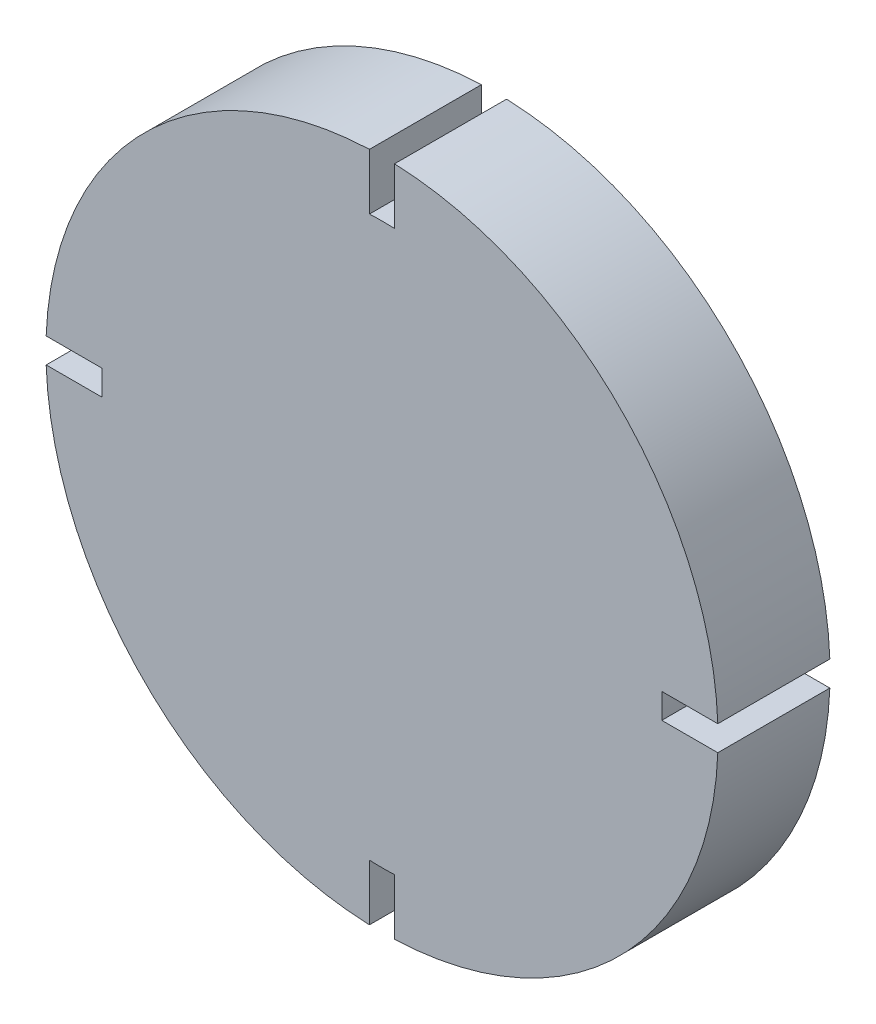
ISO-10303-21;
HEADER;
FILE_DESCRIPTION(('STEP AP214'),'2;1');
FILE_NAME('part.step','',(''),(''),'','','');
FILE_SCHEMA(('AUTOMOTIVE_DESIGN { 1 0 10303 214 1 1 1 1 }'));
ENDSEC;
DATA;
#1=APPLICATION_CONTEXT('core data for automotive mechanical design processes');
#2=APPLICATION_PROTOCOL_DEFINITION('international standard','automotive_design',2000,#1);
#3=PRODUCT_CONTEXT('',#1,'mechanical');
#4=PRODUCT('Part','Part','',(#3));
#5=PRODUCT_RELATED_PRODUCT_CATEGORY('part','',(#4));
#6=PRODUCT_DEFINITION_FORMATION('','',#4);
#7=PRODUCT_DEFINITION_CONTEXT('part definition',#1,'design');
#8=PRODUCT_DEFINITION('design','',#6,#7);
#9=PRODUCT_DEFINITION_SHAPE('','',#8);
#10=(LENGTH_UNIT() NAMED_UNIT(*) SI_UNIT(.MILLI.,.METRE.));
#11=(NAMED_UNIT(*) PLANE_ANGLE_UNIT() SI_UNIT($,.RADIAN.));
#12=(NAMED_UNIT(*) SI_UNIT($,.STERADIAN.) SOLID_ANGLE_UNIT());
#13=UNCERTAINTY_MEASURE_WITH_UNIT(LENGTH_MEASURE(1.E-05),#10,'distance_accuracy_value','');
#14=(GEOMETRIC_REPRESENTATION_CONTEXT(3) GLOBAL_UNCERTAINTY_ASSIGNED_CONTEXT((#13)) GLOBAL_UNIT_ASSIGNED_CONTEXT((#10,
#11,#12)) REPRESENTATION_CONTEXT('',''));
#15=CARTESIAN_POINT('',(0.,0.,0.));
#16=DIRECTION('',(0.,0.,1.));
#17=DIRECTION('',(1.,0.,0.));
#18=AXIS2_PLACEMENT_3D('',#15,#16,#17);
#19=CARTESIAN_POINT('',(0.,0.,10.));
#20=DIRECTION('',(0.,0.,-1.));
#21=DIRECTION('',(-1.,0.,0.));
#22=AXIS2_PLACEMENT_3D('',#19,#20,#21);
#23=CYLINDRICAL_SURFACE('',#22,30.);
#24=CARTESIAN_POINT('',(0.,0.,0.));
#25=DIRECTION('',(0.,0.,1.));
#26=DIRECTION('',(1.,0.,0.));
#27=AXIS2_PLACEMENT_3D('',#24,#25,#26);
#28=CIRCLE('',#27,30.);
#29=CARTESIAN_POINT('',(-1.12,29.9790860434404,0.));
#30=VERTEX_POINT('',#29);
#31=CARTESIAN_POINT('',(-29.9790860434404,1.12,0.));
#32=VERTEX_POINT('',#31);
#33=EDGE_CURVE('E177',#30,#32,#28,.T.);
#34=ORIENTED_EDGE('',*,*,#33,.T.);
#35=DIRECTION('',(0.,0.,-1.));
#36=VECTOR('',#35,1.);
#37=CARTESIAN_POINT('',(-29.9790860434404,1.12,10.));
#38=LINE('',#37,#36);
#39=CARTESIAN_POINT('',(-29.9790860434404,1.12,10.));
#40=VERTEX_POINT('',#39);
#41=EDGE_CURVE('E11',#40,#32,#38,.T.);
#42=ORIENTED_EDGE('',*,*,#41,.F.);
#43=CARTESIAN_POINT('',(0.,0.,10.));
#44=DIRECTION('',(0.,0.,1.));
#45=DIRECTION('',(1.,0.,0.));
#46=AXIS2_PLACEMENT_3D('',#43,#44,#45);
#47=CIRCLE('',#46,30.);
#48=CARTESIAN_POINT('',(-1.12,29.9790860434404,10.));
#49=VERTEX_POINT('',#48);
#50=EDGE_CURVE('E207',#49,#40,#47,.T.);
#51=ORIENTED_EDGE('',*,*,#50,.F.);
#52=DIRECTION('',(0.,0.,-1.));
#53=VECTOR('',#52,1.);
#54=CARTESIAN_POINT('',(-1.12,29.9790860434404,10.));
#55=LINE('',#54,#53);
#56=EDGE_CURVE('E173',#49,#30,#55,.T.);
#57=ORIENTED_EDGE('',*,*,#56,.T.);
#58=EDGE_LOOP('',(#34,#42,#51,#57));
#59=FACE_BOUND('',#58,.T.);
#60=ADVANCED_FACE('F33',(#59),#23,.T.);
#61=CARTESIAN_POINT('',(-29.9790860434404,1.12,10.));
#62=DIRECTION('',(0.,1.,0.));
#63=DIRECTION('',(-1.,0.,0.));
#64=AXIS2_PLACEMENT_3D('',#61,#62,#63);
#65=PLANE('',#64);
#66=DIRECTION('',(1.,0.,0.));
#67=VECTOR('',#66,1.);
#68=CARTESIAN_POINT('',(-29.9790860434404,1.12,0.));
#69=LINE('',#68,#67);
#70=CARTESIAN_POINT('',(-24.9748993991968,1.12,0.));
#71=VERTEX_POINT('',#70);
#72=EDGE_CURVE('E180',#32,#71,#69,.T.);
#73=ORIENTED_EDGE('',*,*,#72,.T.);
#74=DIRECTION('',(0.,0.,-1.));
#75=VECTOR('',#74,1.);
#76=CARTESIAN_POINT('',(-24.9748993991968,1.12,10.));
#77=LINE('',#76,#75);
#78=CARTESIAN_POINT('',(-24.9748993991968,1.12,10.));
#79=VERTEX_POINT('',#78);
#80=EDGE_CURVE('E41',#79,#71,#77,.T.);
#81=ORIENTED_EDGE('',*,*,#80,.F.);
#82=DIRECTION('',(1.,0.,0.));
#83=VECTOR('',#82,1.);
#84=CARTESIAN_POINT('',(-29.9790860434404,1.12,10.));
#85=LINE('',#84,#83);
#86=EDGE_CURVE('E116',#40,#79,#85,.T.);
#87=ORIENTED_EDGE('',*,*,#86,.F.);
#88=ORIENTED_EDGE('',*,*,#41,.T.);
#89=EDGE_LOOP('',(#73,#81,#87,#88));
#90=FACE_BOUND('',#89,.T.);
#91=ADVANCED_FACE('F305',(#90),#65,.F.);
#92=CARTESIAN_POINT('',(0.,0.,10.));
#93=DIRECTION('',(0.,0.,-1.));
#94=DIRECTION('',(-1.,0.,0.));
#95=AXIS2_PLACEMENT_3D('',#92,#93,#94);
#96=CYLINDRICAL_SURFACE('',#95,25.);
#97=CARTESIAN_POINT('',(0.,0.,0.));
#98=DIRECTION('',(0.,0.,1.));
#99=DIRECTION('',(1.,0.,0.));
#100=AXIS2_PLACEMENT_3D('',#97,#98,#99);
#101=CIRCLE('',#100,25.);
#102=CARTESIAN_POINT('',(-24.9748993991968,-1.12000000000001,0.));
#103=VERTEX_POINT('',#102);
#104=EDGE_CURVE('E182',#71,#103,#101,.T.);
#105=ORIENTED_EDGE('',*,*,#104,.T.);
#106=DIRECTION('',(0.,0.,-1.));
#107=VECTOR('',#106,1.);
#108=CARTESIAN_POINT('',(-24.9748993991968,-1.12000000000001,10.));
#109=LINE('',#108,#107);
#110=CARTESIAN_POINT('',(-24.9748993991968,-1.12000000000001,10.));
#111=VERTEX_POINT('',#110);
#112=EDGE_CURVE('E238',#111,#103,#109,.T.);
#113=ORIENTED_EDGE('',*,*,#112,.F.);
#114=CARTESIAN_POINT('',(0.,0.,10.));
#115=DIRECTION('',(0.,0.,1.));
#116=DIRECTION('',(1.,0.,0.));
#117=AXIS2_PLACEMENT_3D('',#114,#115,#116);
#118=CIRCLE('',#117,25.);
#119=EDGE_CURVE('E246',#79,#111,#118,.T.);
#120=ORIENTED_EDGE('',*,*,#119,.F.);
#121=ORIENTED_EDGE('',*,*,#80,.T.);
#122=EDGE_LOOP('',(#105,#113,#120,#121));
#123=FACE_BOUND('',#122,.T.);
#124=ADVANCED_FACE('F244',(#123),#96,.T.);
#125=CARTESIAN_POINT('',(-29.9790860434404,-1.12000000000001,10.));
#126=DIRECTION('',(0.,-1.,0.));
#127=DIRECTION('',(1.,0.,0.));
#128=AXIS2_PLACEMENT_3D('',#125,#126,#127);
#129=PLANE('',#128);
#130=DIRECTION('',(-1.,0.,0.));
#131=VECTOR('',#130,1.);
#132=CARTESIAN_POINT('',(-29.9790860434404,-1.12000000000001,0.));
#133=LINE('',#132,#131);
#134=CARTESIAN_POINT('',(-29.9790860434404,-1.12000000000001,0.));
#135=VERTEX_POINT('',#134);
#136=EDGE_CURVE('E184',#103,#135,#133,.T.);
#137=ORIENTED_EDGE('',*,*,#136,.T.);
#138=DIRECTION('',(0.,0.,-1.));
#139=VECTOR('',#138,1.);
#140=CARTESIAN_POINT('',(-29.9790860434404,-1.12000000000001,10.));
#141=LINE('',#140,#139);
#142=CARTESIAN_POINT('',(-29.9790860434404,-1.12000000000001,10.));
#143=VERTEX_POINT('',#142);
#144=EDGE_CURVE('E235',#143,#135,#141,.T.);
#145=ORIENTED_EDGE('',*,*,#144,.F.);
#146=DIRECTION('',(-1.,0.,0.));
#147=VECTOR('',#146,1.);
#148=CARTESIAN_POINT('',(-29.9790860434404,-1.12000000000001,10.));
#149=LINE('',#148,#147);
#150=EDGE_CURVE('E264',#111,#143,#149,.T.);
#151=ORIENTED_EDGE('',*,*,#150,.F.);
#152=ORIENTED_EDGE('',*,*,#112,.T.);
#153=EDGE_LOOP('',(#137,#145,#151,#152));
#154=FACE_BOUND('',#153,.T.);
#155=ADVANCED_FACE('F255',(#154),#129,.F.);
#156=CARTESIAN_POINT('',(0.,0.,10.));
#157=DIRECTION('',(0.,0.,-1.));
#158=DIRECTION('',(-1.,0.,0.));
#159=AXIS2_PLACEMENT_3D('',#156,#157,#158);
#160=CYLINDRICAL_SURFACE('',#159,30.);
#161=CARTESIAN_POINT('',(0.,0.,0.));
#162=DIRECTION('',(0.,0.,1.));
#163=DIRECTION('',(1.,0.,0.));
#164=AXIS2_PLACEMENT_3D('',#161,#162,#163);
#165=CIRCLE('',#164,30.);
#166=CARTESIAN_POINT('',(-1.12,-29.9790860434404,0.));
#167=VERTEX_POINT('',#166);
#168=EDGE_CURVE('E186',#135,#167,#165,.T.);
#169=ORIENTED_EDGE('',*,*,#168,.T.);
#170=DIRECTION('',(0.,0.,-1.));
#171=VECTOR('',#170,1.);
#172=CARTESIAN_POINT('',(-1.12,-29.9790860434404,10.));
#173=LINE('',#172,#171);
#174=CARTESIAN_POINT('',(-1.12,-29.9790860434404,10.));
#175=VERTEX_POINT('',#174);
#176=EDGE_CURVE('E232',#175,#167,#173,.T.);
#177=ORIENTED_EDGE('',*,*,#176,.F.);
#178=CARTESIAN_POINT('',(0.,0.,10.));
#179=DIRECTION('',(0.,0.,1.));
#180=DIRECTION('',(1.,0.,0.));
#181=AXIS2_PLACEMENT_3D('',#178,#179,#180);
#182=CIRCLE('',#181,30.);
#183=EDGE_CURVE('E261',#143,#175,#182,.T.);
#184=ORIENTED_EDGE('',*,*,#183,.F.);
#185=ORIENTED_EDGE('',*,*,#144,.T.);
#186=EDGE_LOOP('',(#169,#177,#184,#185));
#187=FACE_BOUND('',#186,.T.);
#188=ADVANCED_FACE('F259',(#187),#160,.T.);
#189=CARTESIAN_POINT('',(-1.12,-29.9790860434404,10.));
#190=DIRECTION('',(-1.,0.,0.));
#191=DIRECTION('',(0.,-1.,0.));
#192=AXIS2_PLACEMENT_3D('',#189,#190,#191);
#193=PLANE('',#192);
#194=DIRECTION('',(0.,1.,0.));
#195=VECTOR('',#194,1.);
#196=CARTESIAN_POINT('',(-1.12,-29.9790860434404,0.));
#197=LINE('',#196,#195);
#198=CARTESIAN_POINT('',(-1.12000000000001,-24.9748993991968,0.));
#199=VERTEX_POINT('',#198);
#200=EDGE_CURVE('E188',#167,#199,#197,.T.);
#201=ORIENTED_EDGE('',*,*,#200,.T.);
#202=DIRECTION('',(0.,0.,-1.));
#203=VECTOR('',#202,1.);
#204=CARTESIAN_POINT('',(-1.12000000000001,-24.9748993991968,10.));
#205=LINE('',#204,#203);
#206=CARTESIAN_POINT('',(-1.12000000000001,-24.9748993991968,10.));
#207=VERTEX_POINT('',#206);
#208=EDGE_CURVE('E229',#207,#199,#205,.T.);
#209=ORIENTED_EDGE('',*,*,#208,.F.);
#210=DIRECTION('',(0.,1.,0.));
#211=VECTOR('',#210,1.);
#212=CARTESIAN_POINT('',(-1.12,-29.9790860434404,10.));
#213=LINE('',#212,#211);
#214=EDGE_CURVE('E263',#175,#207,#213,.T.);
#215=ORIENTED_EDGE('',*,*,#214,.F.);
#216=ORIENTED_EDGE('',*,*,#176,.T.);
#217=EDGE_LOOP('',(#201,#209,#215,#216));
#218=FACE_BOUND('',#217,.T.);
#219=ADVANCED_FACE('F318',(#218),#193,.F.);
#220=CARTESIAN_POINT('',(0.,0.,10.));
#221=DIRECTION('',(0.,0.,-1.));
#222=DIRECTION('',(-1.,0.,0.));
#223=AXIS2_PLACEMENT_3D('',#220,#221,#222);
#224=CYLINDRICAL_SURFACE('',#223,25.);
#225=CARTESIAN_POINT('',(0.,0.,0.));
#226=DIRECTION('',(0.,0.,1.));
#227=DIRECTION('',(1.,0.,0.));
#228=AXIS2_PLACEMENT_3D('',#225,#226,#227);
#229=CIRCLE('',#228,25.);
#230=CARTESIAN_POINT('',(1.12000000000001,-24.9748993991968,0.));
#231=VERTEX_POINT('',#230);
#232=EDGE_CURVE('E190',#199,#231,#229,.T.);
#233=ORIENTED_EDGE('',*,*,#232,.T.);
#234=DIRECTION('',(0.,0.,-1.));
#235=VECTOR('',#234,1.);
#236=CARTESIAN_POINT('',(1.12000000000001,-24.9748993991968,10.));
#237=LINE('',#236,#235);
#238=CARTESIAN_POINT('',(1.12000000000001,-24.9748993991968,10.));
#239=VERTEX_POINT('',#238);
#240=EDGE_CURVE('E226',#239,#231,#237,.T.);
#241=ORIENTED_EDGE('',*,*,#240,.F.);
#242=CARTESIAN_POINT('',(0.,0.,10.));
#243=DIRECTION('',(0.,0.,1.));
#244=DIRECTION('',(1.,0.,0.));
#245=AXIS2_PLACEMENT_3D('',#242,#243,#244);
#246=CIRCLE('',#245,25.);
#247=EDGE_CURVE('E266',#207,#239,#246,.T.);
#248=ORIENTED_EDGE('',*,*,#247,.F.);
#249=ORIENTED_EDGE('',*,*,#208,.T.);
#250=EDGE_LOOP('',(#233,#241,#248,#249));
#251=FACE_BOUND('',#250,.T.);
#252=ADVANCED_FACE('F321',(#251),#224,.T.);
#253=CARTESIAN_POINT('',(1.12000000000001,-29.9790860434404,10.));
#254=DIRECTION('',(1.,0.,0.));
#255=DIRECTION('',(0.,1.,0.));
#256=AXIS2_PLACEMENT_3D('',#253,#254,#255);
#257=PLANE('',#256);
#258=DIRECTION('',(0.,-1.,0.));
#259=VECTOR('',#258,1.);
#260=CARTESIAN_POINT('',(1.12000000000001,-29.9790860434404,0.));
#261=LINE('',#260,#259);
#262=CARTESIAN_POINT('',(1.12000000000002,-29.9790860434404,0.));
#263=VERTEX_POINT('',#262);
#264=EDGE_CURVE('E192',#231,#263,#261,.T.);
#265=ORIENTED_EDGE('',*,*,#264,.T.);
#266=DIRECTION('',(0.,0.,-1.));
#267=VECTOR('',#266,1.);
#268=CARTESIAN_POINT('',(1.12000000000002,-29.9790860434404,10.));
#269=LINE('',#268,#267);
#270=CARTESIAN_POINT('',(1.12000000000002,-29.9790860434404,10.));
#271=VERTEX_POINT('',#270);
#272=EDGE_CURVE('E223',#271,#263,#269,.T.);
#273=ORIENTED_EDGE('',*,*,#272,.F.);
#274=DIRECTION('',(0.,-1.,0.));
#275=VECTOR('',#274,1.);
#276=CARTESIAN_POINT('',(1.12000000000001,-29.9790860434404,10.));
#277=LINE('',#276,#275);
#278=EDGE_CURVE('E272',#239,#271,#277,.T.);
#279=ORIENTED_EDGE('',*,*,#278,.F.);
#280=ORIENTED_EDGE('',*,*,#240,.T.);
#281=EDGE_LOOP('',(#265,#273,#279,#280));
#282=FACE_BOUND('',#281,.T.);
#283=ADVANCED_FACE('F325',(#282),#257,.F.);
#284=CARTESIAN_POINT('',(0.,0.,10.));
#285=DIRECTION('',(0.,0.,-1.));
#286=DIRECTION('',(-1.,0.,0.));
#287=AXIS2_PLACEMENT_3D('',#284,#285,#286);
#288=CYLINDRICAL_SURFACE('',#287,30.);
#289=CARTESIAN_POINT('',(0.,0.,0.));
#290=DIRECTION('',(0.,0.,1.));
#291=DIRECTION('',(1.,0.,0.));
#292=AXIS2_PLACEMENT_3D('',#289,#290,#291);
#293=CIRCLE('',#292,30.);
#294=CARTESIAN_POINT('',(29.9790860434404,-1.12,0.));
#295=VERTEX_POINT('',#294);
#296=EDGE_CURVE('E194',#263,#295,#293,.T.);
#297=ORIENTED_EDGE('',*,*,#296,.T.);
#298=DIRECTION('',(0.,0.,-1.));
#299=VECTOR('',#298,1.);
#300=CARTESIAN_POINT('',(29.9790860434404,-1.12,10.));
#301=LINE('',#300,#299);
#302=CARTESIAN_POINT('',(29.9790860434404,-1.12,10.));
#303=VERTEX_POINT('',#302);
#304=EDGE_CURVE('E220',#303,#295,#301,.T.);
#305=ORIENTED_EDGE('',*,*,#304,.F.);
#306=CARTESIAN_POINT('',(0.,0.,10.));
#307=DIRECTION('',(0.,0.,1.));
#308=DIRECTION('',(1.,0.,0.));
#309=AXIS2_PLACEMENT_3D('',#306,#307,#308);
#310=CIRCLE('',#309,30.);
#311=EDGE_CURVE('E274',#271,#303,#310,.T.);
#312=ORIENTED_EDGE('',*,*,#311,.F.);
#313=ORIENTED_EDGE('',*,*,#272,.T.);
#314=EDGE_LOOP('',(#297,#305,#312,#313));
#315=FACE_BOUND('',#314,.T.);
#316=ADVANCED_FACE('F329',(#315),#288,.T.);
#317=CARTESIAN_POINT('',(29.9790860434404,-1.12,10.));
#318=DIRECTION('',(0.,-1.,0.));
#319=DIRECTION('',(1.,0.,0.));
#320=AXIS2_PLACEMENT_3D('',#317,#318,#319);
#321=PLANE('',#320);
#322=DIRECTION('',(-1.,0.,0.));
#323=VECTOR('',#322,1.);
#324=CARTESIAN_POINT('',(29.9790860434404,-1.12,0.));
#325=LINE('',#324,#323);
#326=CARTESIAN_POINT('',(24.9748993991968,-1.12000000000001,0.));
#327=VERTEX_POINT('',#326);
#328=EDGE_CURVE('E196',#295,#327,#325,.T.);
#329=ORIENTED_EDGE('',*,*,#328,.T.);
#330=DIRECTION('',(0.,0.,-1.));
#331=VECTOR('',#330,1.);
#332=CARTESIAN_POINT('',(24.9748993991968,-1.12000000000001,10.));
#333=LINE('',#332,#331);
#334=CARTESIAN_POINT('',(24.9748993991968,-1.12000000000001,10.));
#335=VERTEX_POINT('',#334);
#336=EDGE_CURVE('E217',#335,#327,#333,.T.);
#337=ORIENTED_EDGE('',*,*,#336,.F.);
#338=DIRECTION('',(-1.,0.,0.));
#339=VECTOR('',#338,1.);
#340=CARTESIAN_POINT('',(29.9790860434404,-1.12,10.));
#341=LINE('',#340,#339);
#342=EDGE_CURVE('E276',#303,#335,#341,.T.);
#343=ORIENTED_EDGE('',*,*,#342,.F.);
#344=ORIENTED_EDGE('',*,*,#304,.T.);
#345=EDGE_LOOP('',(#329,#337,#343,#344));
#346=FACE_BOUND('',#345,.T.);
#347=ADVANCED_FACE('F333',(#346),#321,.F.);
#348=CARTESIAN_POINT('',(0.,0.,10.));
#349=DIRECTION('',(0.,0.,-1.));
#350=DIRECTION('',(-1.,0.,0.));
#351=AXIS2_PLACEMENT_3D('',#348,#349,#350);
#352=CYLINDRICAL_SURFACE('',#351,25.);
#353=CARTESIAN_POINT('',(0.,0.,0.));
#354=DIRECTION('',(0.,0.,1.));
#355=DIRECTION('',(1.,0.,0.));
#356=AXIS2_PLACEMENT_3D('',#353,#354,#355);
#357=CIRCLE('',#356,25.);
#358=CARTESIAN_POINT('',(24.9748993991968,1.12000000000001,0.));
#359=VERTEX_POINT('',#358);
#360=EDGE_CURVE('E198',#327,#359,#357,.T.);
#361=ORIENTED_EDGE('',*,*,#360,.T.);
#362=DIRECTION('',(0.,0.,-1.));
#363=VECTOR('',#362,1.);
#364=CARTESIAN_POINT('',(24.9748993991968,1.12000000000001,10.));
#365=LINE('',#364,#363);
#366=CARTESIAN_POINT('',(24.9748993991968,1.12000000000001,10.));
#367=VERTEX_POINT('',#366);
#368=EDGE_CURVE('E214',#367,#359,#365,.T.);
#369=ORIENTED_EDGE('',*,*,#368,.F.);
#370=CARTESIAN_POINT('',(0.,0.,10.));
#371=DIRECTION('',(0.,0.,1.));
#372=DIRECTION('',(1.,0.,0.));
#373=AXIS2_PLACEMENT_3D('',#370,#371,#372);
#374=CIRCLE('',#373,25.);
#375=EDGE_CURVE('E278',#335,#367,#374,.T.);
#376=ORIENTED_EDGE('',*,*,#375,.F.);
#377=ORIENTED_EDGE('',*,*,#336,.T.);
#378=EDGE_LOOP('',(#361,#369,#376,#377));
#379=FACE_BOUND('',#378,.T.);
#380=ADVANCED_FACE('F337',(#379),#352,.T.);
#381=CARTESIAN_POINT('',(29.9790860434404,1.12000000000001,10.));
#382=DIRECTION('',(0.,1.,0.));
#383=DIRECTION('',(-1.,0.,0.));
#384=AXIS2_PLACEMENT_3D('',#381,#382,#383);
#385=PLANE('',#384);
#386=DIRECTION('',(1.,0.,0.));
#387=VECTOR('',#386,1.);
#388=CARTESIAN_POINT('',(29.9790860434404,1.12000000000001,0.));
#389=LINE('',#388,#387);
#390=CARTESIAN_POINT('',(29.9790860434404,1.12000000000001,0.));
#391=VERTEX_POINT('',#390);
#392=EDGE_CURVE('E200',#359,#391,#389,.T.);
#393=ORIENTED_EDGE('',*,*,#392,.T.);
#394=DIRECTION('',(0.,0.,-1.));
#395=VECTOR('',#394,1.);
#396=CARTESIAN_POINT('',(29.9790860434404,1.12000000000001,10.));
#397=LINE('',#396,#395);
#398=CARTESIAN_POINT('',(29.9790860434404,1.12000000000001,10.));
#399=VERTEX_POINT('',#398);
#400=EDGE_CURVE('E211',#399,#391,#397,.T.);
#401=ORIENTED_EDGE('',*,*,#400,.F.);
#402=DIRECTION('',(1.,0.,0.));
#403=VECTOR('',#402,1.);
#404=CARTESIAN_POINT('',(29.9790860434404,1.12000000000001,10.));
#405=LINE('',#404,#403);
#406=EDGE_CURVE('E280',#367,#399,#405,.T.);
#407=ORIENTED_EDGE('',*,*,#406,.F.);
#408=ORIENTED_EDGE('',*,*,#368,.T.);
#409=EDGE_LOOP('',(#393,#401,#407,#408));
#410=FACE_BOUND('',#409,.T.);
#411=ADVANCED_FACE('F286',(#410),#385,.F.);
#412=CARTESIAN_POINT('',(0.,0.,10.));
#413=DIRECTION('',(0.,0.,-1.));
#414=DIRECTION('',(-1.,0.,0.));
#415=AXIS2_PLACEMENT_3D('',#412,#413,#414);
#416=CYLINDRICAL_SURFACE('',#415,30.);
#417=CARTESIAN_POINT('',(0.,0.,0.));
#418=DIRECTION('',(0.,0.,1.));
#419=DIRECTION('',(1.,0.,0.));
#420=AXIS2_PLACEMENT_3D('',#417,#418,#419);
#421=CIRCLE('',#420,30.);
#422=CARTESIAN_POINT('',(1.12,29.9790860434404,0.));
#423=VERTEX_POINT('',#422);
#424=EDGE_CURVE('E202',#391,#423,#421,.T.);
#425=ORIENTED_EDGE('',*,*,#424,.T.);
#426=DIRECTION('',(0.,0.,-1.));
#427=VECTOR('',#426,1.);
#428=CARTESIAN_POINT('',(1.12,29.9790860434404,10.));
#429=LINE('',#428,#427);
#430=CARTESIAN_POINT('',(1.12,29.9790860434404,10.));
#431=VERTEX_POINT('',#430);
#432=EDGE_CURVE('E168',#431,#423,#429,.T.);
#433=ORIENTED_EDGE('',*,*,#432,.F.);
#434=CARTESIAN_POINT('',(0.,0.,10.));
#435=DIRECTION('',(0.,0.,1.));
#436=DIRECTION('',(1.,0.,0.));
#437=AXIS2_PLACEMENT_3D('',#434,#435,#436);
#438=CIRCLE('',#437,30.);
#439=EDGE_CURVE('E159',#399,#431,#438,.T.);
#440=ORIENTED_EDGE('',*,*,#439,.F.);
#441=ORIENTED_EDGE('',*,*,#400,.T.);
#442=EDGE_LOOP('',(#425,#433,#440,#441));
#443=FACE_BOUND('',#442,.T.);
#444=ADVANCED_FACE('F290',(#443),#416,.T.);
#445=CARTESIAN_POINT('',(1.12,29.9790860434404,10.));
#446=DIRECTION('',(1.,0.,0.));
#447=DIRECTION('',(0.,1.,0.));
#448=AXIS2_PLACEMENT_3D('',#445,#446,#447);
#449=PLANE('',#448);
#450=DIRECTION('',(0.,-1.,0.));
#451=VECTOR('',#450,1.);
#452=CARTESIAN_POINT('',(1.12,29.9790860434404,0.));
#453=LINE('',#452,#451);
#454=CARTESIAN_POINT('',(1.12,24.9748993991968,0.));
#455=VERTEX_POINT('',#454);
#456=EDGE_CURVE('E167',#423,#455,#453,.T.);
#457=ORIENTED_EDGE('',*,*,#456,.T.);
#458=DIRECTION('',(0.,0.,-1.));
#459=VECTOR('',#458,1.);
#460=CARTESIAN_POINT('',(1.12,24.9748993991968,10.));
#461=LINE('',#460,#459);
#462=CARTESIAN_POINT('',(1.12,24.9748993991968,10.));
#463=VERTEX_POINT('',#462);
#464=EDGE_CURVE('E164',#463,#455,#461,.T.);
#465=ORIENTED_EDGE('',*,*,#464,.F.);
#466=DIRECTION('',(0.,-1.,0.));
#467=VECTOR('',#466,1.);
#468=CARTESIAN_POINT('',(1.12,29.9790860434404,10.));
#469=LINE('',#468,#467);
#470=EDGE_CURVE('E153',#431,#463,#469,.T.);
#471=ORIENTED_EDGE('',*,*,#470,.F.);
#472=ORIENTED_EDGE('',*,*,#432,.T.);
#473=EDGE_LOOP('',(#457,#465,#471,#472));
#474=FACE_BOUND('',#473,.T.);
#475=ADVANCED_FACE('F165',(#474),#449,.F.);
#476=CARTESIAN_POINT('',(0.,0.,10.));
#477=DIRECTION('',(0.,0.,-1.));
#478=DIRECTION('',(-1.,0.,0.));
#479=AXIS2_PLACEMENT_3D('',#476,#477,#478);
#480=CYLINDRICAL_SURFACE('',#479,25.);
#481=CARTESIAN_POINT('',(0.,0.,0.));
#482=DIRECTION('',(0.,0.,1.));
#483=DIRECTION('',(1.,0.,0.));
#484=AXIS2_PLACEMENT_3D('',#481,#482,#483);
#485=CIRCLE('',#484,25.);
#486=CARTESIAN_POINT('',(-1.12,24.9748993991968,0.));
#487=VERTEX_POINT('',#486);
#488=EDGE_CURVE('E102',#455,#487,#485,.T.);
#489=ORIENTED_EDGE('',*,*,#488,.T.);
#490=DIRECTION('',(0.,0.,-1.));
#491=VECTOR('',#490,1.);
#492=CARTESIAN_POINT('',(-1.12,24.9748993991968,10.));
#493=LINE('',#492,#491);
#494=CARTESIAN_POINT('',(-1.12,24.9748993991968,10.));
#495=VERTEX_POINT('',#494);
#496=EDGE_CURVE('E169',#495,#487,#493,.T.);
#497=ORIENTED_EDGE('',*,*,#496,.F.);
#498=CARTESIAN_POINT('',(0.,0.,10.));
#499=DIRECTION('',(0.,0.,1.));
#500=DIRECTION('',(1.,0.,0.));
#501=AXIS2_PLACEMENT_3D('',#498,#499,#500);
#502=CIRCLE('',#501,25.);
#503=EDGE_CURVE('E157',#463,#495,#502,.T.);
#504=ORIENTED_EDGE('',*,*,#503,.F.);
#505=ORIENTED_EDGE('',*,*,#464,.T.);
#506=EDGE_LOOP('',(#489,#497,#504,#505));
#507=FACE_BOUND('',#506,.T.);
#508=ADVANCED_FACE('F171',(#507),#480,.T.);
#509=CARTESIAN_POINT('',(-1.12,29.9790860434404,10.));
#510=DIRECTION('',(-1.,0.,0.));
#511=DIRECTION('',(0.,-1.,0.));
#512=AXIS2_PLACEMENT_3D('',#509,#510,#511);
#513=PLANE('',#512);
#514=DIRECTION('',(0.,1.,0.));
#515=VECTOR('',#514,1.);
#516=CARTESIAN_POINT('',(-1.12,29.9790860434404,0.));
#517=LINE('',#516,#515);
#518=EDGE_CURVE('E108',#487,#30,#517,.T.);
#519=ORIENTED_EDGE('',*,*,#518,.T.);
#520=ORIENTED_EDGE('',*,*,#56,.F.);
#521=DIRECTION('',(0.,1.,0.));
#522=VECTOR('',#521,1.);
#523=CARTESIAN_POINT('',(-1.12,29.9790860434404,10.));
#524=LINE('',#523,#522);
#525=EDGE_CURVE('E49',#495,#49,#524,.T.);
#526=ORIENTED_EDGE('',*,*,#525,.F.);
#527=ORIENTED_EDGE('',*,*,#496,.T.);
#528=EDGE_LOOP('',(#519,#520,#526,#527));
#529=FACE_BOUND('',#528,.T.);
#530=ADVANCED_FACE('F294',(#529),#513,.F.);
#531=CARTESIAN_POINT('',(0.,0.,10.));
#532=DIRECTION('',(0.,0.,1.));
#533=DIRECTION('',(1.,0.,0.));
#534=AXIS2_PLACEMENT_3D('',#531,#532,#533);
#535=PLANE('',#534);
#536=ORIENTED_EDGE('',*,*,#50,.T.);
#537=ORIENTED_EDGE('',*,*,#86,.T.);
#538=ORIENTED_EDGE('',*,*,#119,.T.);
#539=ORIENTED_EDGE('',*,*,#150,.T.);
#540=ORIENTED_EDGE('',*,*,#183,.T.);
#541=ORIENTED_EDGE('',*,*,#214,.T.);
#542=ORIENTED_EDGE('',*,*,#247,.T.);
#543=ORIENTED_EDGE('',*,*,#278,.T.);
#544=ORIENTED_EDGE('',*,*,#311,.T.);
#545=ORIENTED_EDGE('',*,*,#342,.T.);
#546=ORIENTED_EDGE('',*,*,#375,.T.);
#547=ORIENTED_EDGE('',*,*,#406,.T.);
#548=ORIENTED_EDGE('',*,*,#439,.T.);
#549=ORIENTED_EDGE('',*,*,#470,.T.);
#550=ORIENTED_EDGE('',*,*,#503,.T.);
#551=ORIENTED_EDGE('',*,*,#525,.T.);
#552=EDGE_LOOP('',(#536,#537,#538,#539,#540,#541,#542,#543,#544,#545,#546,#547,#548,#549,#550,#551));
#553=FACE_BOUND('',#552,.T.);
#554=ADVANCED_FACE('F155',(#553),#535,.T.);
#555=CARTESIAN_POINT('',(0.,0.,0.));
#556=DIRECTION('',(0.,0.,1.));
#557=DIRECTION('',(1.,0.,0.));
#558=AXIS2_PLACEMENT_3D('',#555,#556,#557);
#559=PLANE('',#558);
#560=ORIENTED_EDGE('',*,*,#33,.F.);
#561=ORIENTED_EDGE('',*,*,#518,.F.);
#562=ORIENTED_EDGE('',*,*,#488,.F.);
#563=ORIENTED_EDGE('',*,*,#456,.F.);
#564=ORIENTED_EDGE('',*,*,#424,.F.);
#565=ORIENTED_EDGE('',*,*,#392,.F.);
#566=ORIENTED_EDGE('',*,*,#360,.F.);
#567=ORIENTED_EDGE('',*,*,#328,.F.);
#568=ORIENTED_EDGE('',*,*,#296,.F.);
#569=ORIENTED_EDGE('',*,*,#264,.F.);
#570=ORIENTED_EDGE('',*,*,#232,.F.);
#571=ORIENTED_EDGE('',*,*,#200,.F.);
#572=ORIENTED_EDGE('',*,*,#168,.F.);
#573=ORIENTED_EDGE('',*,*,#136,.F.);
#574=ORIENTED_EDGE('',*,*,#104,.F.);
#575=ORIENTED_EDGE('',*,*,#72,.F.);
#576=EDGE_LOOP('',(#560,#561,#562,#563,#564,#565,#566,#567,#568,#569,#570,#571,#572,#573,#574,#575));
#577=FACE_BOUND('',#576,.T.);
#578=ADVANCED_FACE('F250',(#577),#559,.F.);
#579=CLOSED_SHELL('',(#60,#91,#124,#155,#188,#219,#252,#283,#316,#347,#380,#411,#444,#475,#508,
#530,#554,#578));
#580=MANIFOLD_SOLID_BREP('B2',#579);
#581=ADVANCED_BREP_SHAPE_REPRESENTATION('',(#18,#580),#14);
#582=SHAPE_DEFINITION_REPRESENTATION(#9,#581);
ENDSEC;
END-ISO-10303-21;
